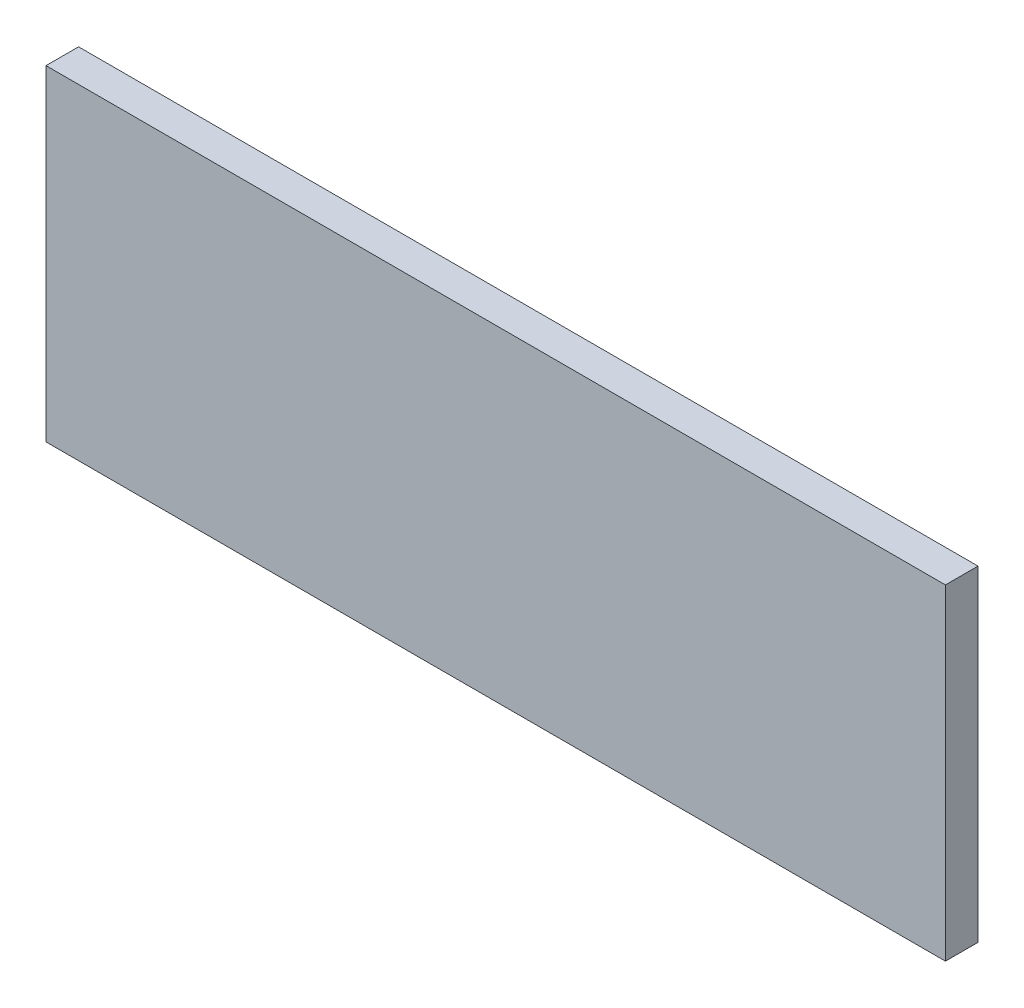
ISO-10303-21;
HEADER;
FILE_DESCRIPTION(('STEP AP214'),'2;1');
FILE_NAME('part.step','',(''),(''),'','','');
FILE_SCHEMA(('AUTOMOTIVE_DESIGN { 1 0 10303 214 1 1 1 1 }'));
ENDSEC;
DATA;
#1=APPLICATION_CONTEXT('core data for automotive mechanical design processes');
#2=APPLICATION_PROTOCOL_DEFINITION('international standard','automotive_design',2000,#1);
#3=PRODUCT_CONTEXT('',#1,'mechanical');
#4=PRODUCT('Part','Part','',(#3));
#5=PRODUCT_RELATED_PRODUCT_CATEGORY('part','',(#4));
#6=PRODUCT_DEFINITION_FORMATION('','',#4);
#7=PRODUCT_DEFINITION_CONTEXT('part definition',#1,'design');
#8=PRODUCT_DEFINITION('design','',#6,#7);
#9=PRODUCT_DEFINITION_SHAPE('','',#8);
#10=(LENGTH_UNIT() NAMED_UNIT(*) SI_UNIT(.MILLI.,.METRE.));
#11=(NAMED_UNIT(*) PLANE_ANGLE_UNIT() SI_UNIT($,.RADIAN.));
#12=(NAMED_UNIT(*) SI_UNIT($,.STERADIAN.) SOLID_ANGLE_UNIT());
#13=UNCERTAINTY_MEASURE_WITH_UNIT(LENGTH_MEASURE(1.E-05),#10,'distance_accuracy_value','');
#14=(GEOMETRIC_REPRESENTATION_CONTEXT(3) GLOBAL_UNCERTAINTY_ASSIGNED_CONTEXT((#13)) GLOBAL_UNIT_ASSIGNED_CONTEXT((#10,
#11,#12)) REPRESENTATION_CONTEXT('',''));
#15=CARTESIAN_POINT('',(0.,0.,0.));
#16=DIRECTION('',(0.,0.,1.));
#17=DIRECTION('',(1.,0.,0.));
#18=AXIS2_PLACEMENT_3D('',#15,#16,#17);
#19=CARTESIAN_POINT('',(0.,5.,0.));
#20=DIRECTION('',(0.,-1.,0.));
#21=DIRECTION('',(-1.,0.,0.));
#22=AXIS2_PLACEMENT_3D('',#19,#20,#21);
#23=PLANE('',#22);
#24=DIRECTION('',(0.,0.,1.));
#25=VECTOR('',#24,1.);
#26=CARTESIAN_POINT('',(110.4,5.,0.));
#27=LINE('',#26,#25);
#28=CARTESIAN_POINT('',(110.4,5.,-0.5));
#29=VERTEX_POINT('',#28);
#30=CARTESIAN_POINT('',(110.4,5.,0.5));
#31=VERTEX_POINT('',#30);
#32=EDGE_CURVE('E11',#29,#31,#27,.T.);
#33=ORIENTED_EDGE('',*,*,#32,.F.);
#34=DIRECTION('',(-1.,0.,0.));
#35=VECTOR('',#34,1.);
#36=CARTESIAN_POINT('',(0.,5.,-0.5));
#37=LINE('',#36,#35);
#38=CARTESIAN_POINT('',(82.8,5.,-0.5));
#39=VERTEX_POINT('',#38);
#40=EDGE_CURVE('E89',#29,#39,#37,.T.);
#41=ORIENTED_EDGE('',*,*,#40,.T.);
#42=DIRECTION('',(0.,0.,1.));
#43=VECTOR('',#42,1.);
#44=CARTESIAN_POINT('',(82.8,5.,0.));
#45=LINE('',#44,#43);
#46=CARTESIAN_POINT('',(82.8,5.,0.5));
#47=VERTEX_POINT('',#46);
#48=EDGE_CURVE('E44',#39,#47,#45,.T.);
#49=ORIENTED_EDGE('',*,*,#48,.T.);
#50=DIRECTION('',(-1.,0.,0.));
#51=VECTOR('',#50,1.);
#52=CARTESIAN_POINT('',(0.,5.,0.5));
#53=LINE('',#52,#51);
#54=EDGE_CURVE('E102',#31,#47,#53,.T.);
#55=ORIENTED_EDGE('',*,*,#54,.F.);
#56=EDGE_LOOP('',(#33,#41,#49,#55));
#57=FACE_BOUND('',#56,.T.);
#58=ADVANCED_FACE('F34',(#57),#23,.F.);
#59=CARTESIAN_POINT('',(82.8,0.,0.));
#60=DIRECTION('',(-1.,0.,0.));
#61=DIRECTION('',(0.,1.,0.));
#62=AXIS2_PLACEMENT_3D('',#59,#60,#61);
#63=PLANE('',#62);
#64=ORIENTED_EDGE('',*,*,#48,.F.);
#65=DIRECTION('',(0.,1.,0.));
#66=VECTOR('',#65,1.);
#67=CARTESIAN_POINT('',(82.8,0.,-0.5));
#68=LINE('',#67,#66);
#69=CARTESIAN_POINT('',(82.8,-4.99999999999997,-0.5));
#70=VERTEX_POINT('',#69);
#71=EDGE_CURVE('E96',#70,#39,#68,.T.);
#72=ORIENTED_EDGE('',*,*,#71,.F.);
#73=DIRECTION('',(0.,0.,1.));
#74=VECTOR('',#73,1.);
#75=CARTESIAN_POINT('',(82.8,-4.99999999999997,0.));
#76=LINE('',#75,#74);
#77=CARTESIAN_POINT('',(82.8,-4.99999999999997,0.5));
#78=VERTEX_POINT('',#77);
#79=EDGE_CURVE('E52',#70,#78,#76,.T.);
#80=ORIENTED_EDGE('',*,*,#79,.T.);
#81=DIRECTION('',(0.,1.,0.));
#82=VECTOR('',#81,1.);
#83=CARTESIAN_POINT('',(82.8,0.,0.5));
#84=LINE('',#83,#82);
#85=EDGE_CURVE('E83',#78,#47,#84,.T.);
#86=ORIENTED_EDGE('',*,*,#85,.T.);
#87=EDGE_LOOP('',(#64,#72,#80,#86));
#88=FACE_BOUND('',#87,.T.);
#89=ADVANCED_FACE('F106',(#88),#63,.T.);
#90=CARTESIAN_POINT('',(0.,-4.99999999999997,0.));
#91=DIRECTION('',(0.,-1.,0.));
#92=DIRECTION('',(-1.,0.,0.));
#93=AXIS2_PLACEMENT_3D('',#90,#91,#92);
#94=PLANE('',#93);
#95=ORIENTED_EDGE('',*,*,#79,.F.);
#96=DIRECTION('',(-1.,0.,0.));
#97=VECTOR('',#96,1.);
#98=CARTESIAN_POINT('',(0.,-4.99999999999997,-0.5));
#99=LINE('',#98,#97);
#100=CARTESIAN_POINT('',(110.4,-4.99999999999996,-0.5));
#101=VERTEX_POINT('',#100);
#102=EDGE_CURVE('E88',#70,#101,#99,.F.);
#103=ORIENTED_EDGE('',*,*,#102,.T.);
#104=DIRECTION('',(0.,0.,1.));
#105=VECTOR('',#104,1.);
#106=CARTESIAN_POINT('',(110.4,-4.99999999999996,0.));
#107=LINE('',#106,#105);
#108=CARTESIAN_POINT('',(110.4,-4.99999999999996,0.5));
#109=VERTEX_POINT('',#108);
#110=EDGE_CURVE('E38',#101,#109,#107,.T.);
#111=ORIENTED_EDGE('',*,*,#110,.T.);
#112=DIRECTION('',(-1.,0.,0.));
#113=VECTOR('',#112,1.);
#114=CARTESIAN_POINT('',(0.,-4.99999999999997,0.5));
#115=LINE('',#114,#113);
#116=EDGE_CURVE('E98',#78,#109,#115,.F.);
#117=ORIENTED_EDGE('',*,*,#116,.F.);
#118=EDGE_LOOP('',(#95,#103,#111,#117));
#119=FACE_BOUND('',#118,.T.);
#120=ADVANCED_FACE('F91',(#119),#94,.T.);
#121=CARTESIAN_POINT('',(110.4,0.,0.));
#122=DIRECTION('',(-1.,0.,0.));
#123=DIRECTION('',(0.,1.,0.));
#124=AXIS2_PLACEMENT_3D('',#121,#122,#123);
#125=PLANE('',#124);
#126=DIRECTION('',(0.,1.,0.));
#127=VECTOR('',#126,1.);
#128=CARTESIAN_POINT('',(110.4,0.,-0.5));
#129=LINE('',#128,#127);
#130=EDGE_CURVE('E77',#101,#29,#129,.T.);
#131=ORIENTED_EDGE('',*,*,#130,.T.);
#132=ORIENTED_EDGE('',*,*,#32,.T.);
#133=DIRECTION('',(0.,1.,0.));
#134=VECTOR('',#133,1.);
#135=CARTESIAN_POINT('',(110.4,0.,0.5));
#136=LINE('',#135,#134);
#137=EDGE_CURVE('E79',#109,#31,#136,.T.);
#138=ORIENTED_EDGE('',*,*,#137,.F.);
#139=ORIENTED_EDGE('',*,*,#110,.F.);
#140=EDGE_LOOP('',(#131,#132,#138,#139));
#141=FACE_BOUND('',#140,.T.);
#142=ADVANCED_FACE('F36',(#141),#125,.F.);
#143=CARTESIAN_POINT('',(0.,0.,0.5));
#144=DIRECTION('',(0.,0.,-1.));
#145=DIRECTION('',(-1.,0.,0.));
#146=AXIS2_PLACEMENT_3D('',#143,#144,#145);
#147=PLANE('',#146);
#148=ORIENTED_EDGE('',*,*,#116,.T.);
#149=ORIENTED_EDGE('',*,*,#137,.T.);
#150=ORIENTED_EDGE('',*,*,#54,.T.);
#151=ORIENTED_EDGE('',*,*,#85,.F.);
#152=EDGE_LOOP('',(#148,#149,#150,#151));
#153=FACE_BOUND('',#152,.T.);
#154=ADVANCED_FACE('F105',(#153),#147,.F.);
#155=CARTESIAN_POINT('',(0.,0.,-0.5));
#156=DIRECTION('',(0.,0.,-1.));
#157=DIRECTION('',(-1.,0.,0.));
#158=AXIS2_PLACEMENT_3D('',#155,#156,#157);
#159=PLANE('',#158);
#160=ORIENTED_EDGE('',*,*,#102,.F.);
#161=ORIENTED_EDGE('',*,*,#71,.T.);
#162=ORIENTED_EDGE('',*,*,#40,.F.);
#163=ORIENTED_EDGE('',*,*,#130,.F.);
#164=EDGE_LOOP('',(#160,#161,#162,#163));
#165=FACE_BOUND('',#164,.T.);
#166=ADVANCED_FACE('F86',(#165),#159,.T.);
#167=CLOSED_SHELL('',(#58,#89,#120,#142,#154,#166));
#168=MANIFOLD_SOLID_BREP('B2',#167);
#169=ADVANCED_BREP_SHAPE_REPRESENTATION('',(#18,#168),#14);
#170=SHAPE_DEFINITION_REPRESENTATION(#9,#169);
ENDSEC;
END-ISO-10303-21;
